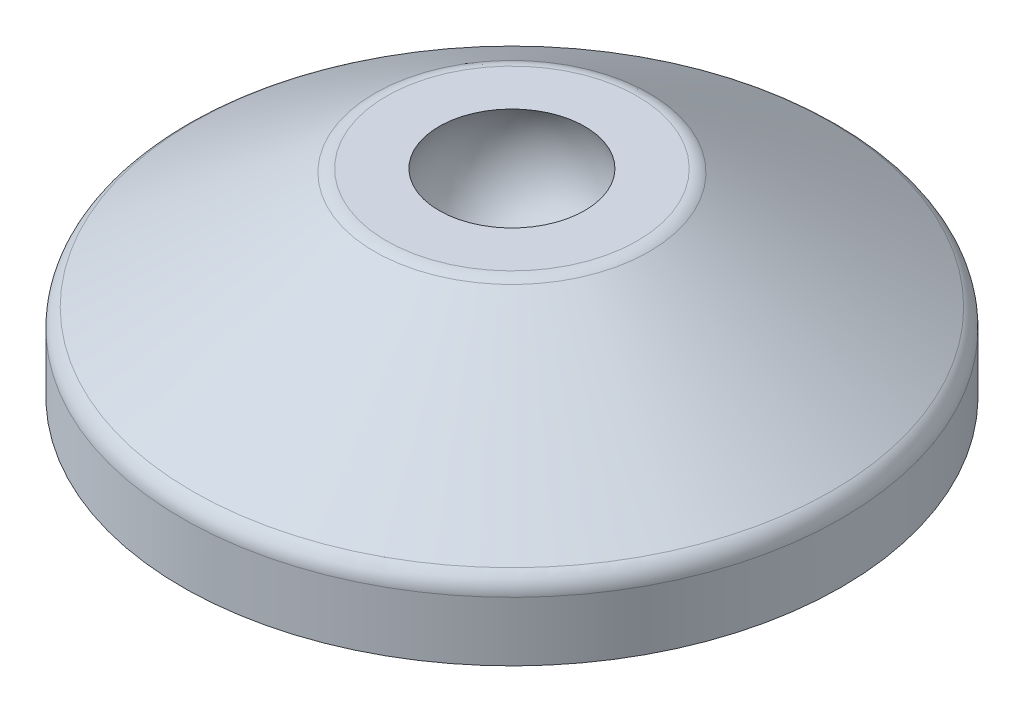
ISO-10303-21;
HEADER;
FILE_DESCRIPTION(('STEP AP214'),'2;1');
FILE_NAME('part.step','',(''),(''),'','','');
FILE_SCHEMA(('AUTOMOTIVE_DESIGN { 1 0 10303 214 1 1 1 1 }'));
ENDSEC;
DATA;
#1=APPLICATION_CONTEXT('core data for automotive mechanical design processes');
#2=APPLICATION_PROTOCOL_DEFINITION('international standard','automotive_design',2000,#1);
#3=PRODUCT_CONTEXT('',#1,'mechanical');
#4=PRODUCT('Part','Part','',(#3));
#5=PRODUCT_RELATED_PRODUCT_CATEGORY('part','',(#4));
#6=PRODUCT_DEFINITION_FORMATION('','',#4);
#7=PRODUCT_DEFINITION_CONTEXT('part definition',#1,'design');
#8=PRODUCT_DEFINITION('design','',#6,#7);
#9=PRODUCT_DEFINITION_SHAPE('','',#8);
#10=(LENGTH_UNIT() NAMED_UNIT(*) SI_UNIT(.MILLI.,.METRE.));
#11=(NAMED_UNIT(*) PLANE_ANGLE_UNIT() SI_UNIT($,.RADIAN.));
#12=(NAMED_UNIT(*) SI_UNIT($,.STERADIAN.) SOLID_ANGLE_UNIT());
#13=UNCERTAINTY_MEASURE_WITH_UNIT(LENGTH_MEASURE(1.E-05),#10,'distance_accuracy_value','');
#14=(GEOMETRIC_REPRESENTATION_CONTEXT(3) GLOBAL_UNCERTAINTY_ASSIGNED_CONTEXT((#13)) GLOBAL_UNIT_ASSIGNED_CONTEXT((#10,
#11,#12)) REPRESENTATION_CONTEXT('',''));
#15=CARTESIAN_POINT('',(0.,0.,0.));
#16=DIRECTION('',(0.,0.,1.));
#17=DIRECTION('',(1.,0.,0.));
#18=AXIS2_PLACEMENT_3D('',#15,#16,#17);
#19=CARTESIAN_POINT('',(0.,0.999999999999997,0.));
#20=DIRECTION('',(0.,1.,0.));
#21=DIRECTION('',(0.,0.,1.));
#22=AXIS2_PLACEMENT_3D('',#19,#20,#21);
#23=PLANE('',#22);
#24=CARTESIAN_POINT('',(0.,0.999999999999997,0.));
#25=DIRECTION('',(0.,1.,0.));
#26=DIRECTION('',(-1.,0.,0.));
#27=AXIS2_PLACEMENT_3D('',#24,#25,#26);
#28=CIRCLE('',#27,7.5);
#29=CARTESIAN_POINT('',(-7.5,0.999999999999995,0.));
#30=VERTEX_POINT('',#29);
#31=EDGE_CURVE('E18',#30,#30,#28,.T.);
#32=ORIENTED_EDGE('',*,*,#31,.F.);
#33=EDGE_LOOP('',(#32));
#34=FACE_BOUND('',#33,.T.);
#35=ADVANCED_FACE('F14',(#34),#23,.F.);
#36=CARTESIAN_POINT('',(0.,0.,0.));
#37=DIRECTION('',(0.,1.,0.));
#38=DIRECTION('',(-1.,0.,0.));
#39=AXIS2_PLACEMENT_3D('',#36,#37,#38);
#40=CYLINDRICAL_SURFACE('',#39,7.5);
#41=CARTESIAN_POINT('',(0.,5.,0.));
#42=DIRECTION('',(0.,1.,0.));
#43=DIRECTION('',(-1.,0.,0.));
#44=AXIS2_PLACEMENT_3D('',#41,#42,#43);
#45=CIRCLE('',#44,7.5);
#46=CARTESIAN_POINT('',(-7.5,4.99999999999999,0.));
#47=VERTEX_POINT('',#46);
#48=EDGE_CURVE('E72',#47,#47,#45,.F.);
#49=ORIENTED_EDGE('',*,*,#48,.T.);
#50=EDGE_LOOP('',(#49));
#51=FACE_BOUND('',#50,.T.);
#52=ORIENTED_EDGE('',*,*,#31,.T.);
#53=EDGE_LOOP('',(#52));
#54=FACE_BOUND('',#53,.T.);
#55=ADVANCED_FACE('F79',(#51,#54),#40,.T.);
#56=CARTESIAN_POINT('',(0.,5.,0.));
#57=DIRECTION('',(0.,1.,0.));
#58=DIRECTION('',(0.,0.,1.));
#59=AXIS2_PLACEMENT_3D('',#56,#57,#58);
#60=PLANE('',#59);
#61=ORIENTED_EDGE('',*,*,#48,.F.);
#62=EDGE_LOOP('',(#61));
#63=FACE_BOUND('',#62,.T.);
#64=CARTESIAN_POINT('',(0.,5.,0.));
#65=DIRECTION('',(0.,1.,0.));
#66=DIRECTION('',(0.,0.,1.));
#67=AXIS2_PLACEMENT_3D('',#64,#65,#66);
#68=CIRCLE('',#67,26.);
#69=CARTESIAN_POINT('',(0.,5.,26.));
#70=VERTEX_POINT('',#69);
#71=EDGE_CURVE('E70',#70,#70,#68,.F.);
#72=ORIENTED_EDGE('',*,*,#71,.T.);
#73=EDGE_LOOP('',(#72));
#74=FACE_BOUND('',#73,.T.);
#75=ADVANCED_FACE('F86',(#63,#74),#60,.F.);
#76=CARTESIAN_POINT('',(0.,0.,0.));
#77=DIRECTION('',(0.,1.,0.));
#78=DIRECTION('',(0.,0.,1.));
#79=AXIS2_PLACEMENT_3D('',#76,#77,#78);
#80=CYLINDRICAL_SURFACE('',#79,26.);
#81=CARTESIAN_POINT('',(0.,0.,0.));
#82=DIRECTION('',(0.,1.,0.));
#83=DIRECTION('',(0.,0.,1.));
#84=AXIS2_PLACEMENT_3D('',#81,#82,#83);
#85=CIRCLE('',#84,26.);
#86=CARTESIAN_POINT('',(0.,0.,26.));
#87=VERTEX_POINT('',#86);
#88=EDGE_CURVE('E67',#87,#87,#85,.T.);
#89=ORIENTED_EDGE('',*,*,#88,.F.);
#90=EDGE_LOOP('',(#89));
#91=FACE_BOUND('',#90,.T.);
#92=ORIENTED_EDGE('',*,*,#71,.F.);
#93=EDGE_LOOP('',(#92));
#94=FACE_BOUND('',#93,.T.);
#95=ADVANCED_FACE('F122',(#91,#94),#80,.F.);
#96=CARTESIAN_POINT('',(15.,0.,0.));
#97=DIRECTION('',(0.,-1.,0.));
#98=DIRECTION('',(0.,0.,-1.));
#99=AXIS2_PLACEMENT_3D('',#96,#97,#98);
#100=PLANE('',#99);
#101=ORIENTED_EDGE('',*,*,#88,.T.);
#102=EDGE_LOOP('',(#101));
#103=FACE_BOUND('',#102,.T.);
#104=CARTESIAN_POINT('',(0.,0.,0.));
#105=DIRECTION('',(0.,-1.,0.));
#106=DIRECTION('',(1.,0.,0.));
#107=AXIS2_PLACEMENT_3D('',#104,#105,#106);
#108=CIRCLE('',#107,30.);
#109=CARTESIAN_POINT('',(30.,0.,0.));
#110=VERTEX_POINT('',#109);
#111=EDGE_CURVE('E64',#110,#110,#108,.F.);
#112=ORIENTED_EDGE('',*,*,#111,.F.);
#113=EDGE_LOOP('',(#112));
#114=FACE_BOUND('',#113,.T.);
#115=ADVANCED_FACE('F119',(#103,#114),#100,.T.);
#116=CARTESIAN_POINT('',(0.,14.5,0.));
#117=DIRECTION('',(0.,0.,1.));
#118=DIRECTION('',(1.,0.,0.));
#119=AXIS2_PLACEMENT_3D('',#116,#117,#118);
#120=SPHERICAL_SURFACE('',#119,7.5);
#121=CARTESIAN_POINT('',(0.,14.5,0.));
#122=DIRECTION('',(0.,1.,0.));
#123=DIRECTION('',(0.,0.,1.));
#124=AXIS2_PLACEMENT_3D('',#121,#122,#123);
#125=SPHERICAL_SURFACE('',#124,7.5);
#126=CARTESIAN_POINT('',(0.,18.,0.));
#127=DIRECTION('',(0.,1.,0.));
#128=DIRECTION('',(0.,0.,1.));
#129=AXIS2_PLACEMENT_3D('',#126,#127,#128);
#130=CIRCLE('',#129,6.6332495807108);
#131=CARTESIAN_POINT('',(0.,18.,6.6332495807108));
#132=VERTEX_POINT('',#131);
#133=EDGE_CURVE('E55',#132,#132,#130,.F.);
#134=ORIENTED_EDGE('',*,*,#133,.F.);
#135=EDGE_LOOP('',(#134));
#136=FACE_BOUND('',#135,.T.);
#137=ADVANCED_FACE('F16',(#136),#125,.F.);
#138=CARTESIAN_POINT('',(0.,2.70222170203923,0.));
#139=DIRECTION('',(0.,-1.,0.));
#140=DIRECTION('',(1.,0.,0.));
#141=AXIS2_PLACEMENT_3D('',#138,#139,#140);
#142=CYLINDRICAL_SURFACE('',#141,30.);
#143=CARTESIAN_POINT('',(0.,5.40444340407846,0.));
#144=DIRECTION('',(0.,-1.,0.));
#145=DIRECTION('',(0.,0.,-1.));
#146=AXIS2_PLACEMENT_3D('',#143,#144,#145);
#147=CIRCLE('',#146,30.);
#148=CARTESIAN_POINT('',(0.,5.40444340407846,-30.));
#149=VERTEX_POINT('',#148);
#150=EDGE_CURVE('E63',#149,#149,#147,.F.);
#151=ORIENTED_EDGE('',*,*,#150,.F.);
#152=EDGE_LOOP('',(#151));
#153=FACE_BOUND('',#152,.T.);
#154=ORIENTED_EDGE('',*,*,#111,.T.);
#155=EDGE_LOOP('',(#154));
#156=FACE_BOUND('',#155,.T.);
#157=ADVANCED_FACE('F115',(#153,#156),#142,.T.);
#158=CARTESIAN_POINT('',(9.02445006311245,18.,0.));
#159=DIRECTION('',(0.,1.,0.));
#160=DIRECTION('',(0.,0.,1.));
#161=AXIS2_PLACEMENT_3D('',#158,#159,#160);
#162=PLANE('',#161);
#163=ORIENTED_EDGE('',*,*,#133,.T.);
#164=EDGE_LOOP('',(#163));
#165=FACE_BOUND('',#164,.T.);
#166=CARTESIAN_POINT('',(0.,18.,0.));
#167=DIRECTION('',(0.,-1.,0.));
#168=DIRECTION('',(1.,0.,0.));
#169=AXIS2_PLACEMENT_3D('',#166,#167,#168);
#170=CIRCLE('',#169,11.4156505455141);
#171=CARTESIAN_POINT('',(11.4156505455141,18.,0.));
#172=VERTEX_POINT('',#171);
#173=EDGE_CURVE('E27',#172,#172,#170,.T.);
#174=ORIENTED_EDGE('',*,*,#173,.F.);
#175=EDGE_LOOP('',(#174));
#176=FACE_BOUND('',#175,.T.);
#177=ADVANCED_FACE('F96',(#165,#176),#162,.T.);
#178=CARTESIAN_POINT('',(0.,5.40444340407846,0.));
#179=DIRECTION('',(0.,-1.,0.));
#180=DIRECTION('',(0.,0.,-1.));
#181=AXIS2_PLACEMENT_3D('',#178,#179,#180);
#182=TOROIDAL_SURFACE('',#181,28.,2.);
#183=CARTESIAN_POINT('',(0.,7.08983591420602,0.));
#184=DIRECTION('',(0.,-1.,0.));
#185=DIRECTION('',(1.,0.,0.));
#186=AXIS2_PLACEMENT_3D('',#183,#184,#185);
#187=CIRCLE('',#186,29.076778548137);
#188=CARTESIAN_POINT('',(29.076778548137,7.08983591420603,0.));
#189=VERTEX_POINT('',#188);
#190=EDGE_CURVE('E22',#189,#189,#187,.F.);
#191=ORIENTED_EDGE('',*,*,#190,.F.);
#192=EDGE_LOOP('',(#191));
#193=FACE_BOUND('',#192,.T.);
#194=ORIENTED_EDGE('',*,*,#150,.T.);
#195=EDGE_LOOP('',(#194));
#196=FACE_BOUND('',#195,.T.);
#197=ADVANCED_FACE('F45',(#193,#196),#182,.T.);
#198=CARTESIAN_POINT('',(0.,16.,0.));
#199=DIRECTION('',(0.,-1.,0.));
#200=DIRECTION('',(0.,0.,-1.));
#201=AXIS2_PLACEMENT_3D('',#198,#199,#200);
#202=TOROIDAL_SURFACE('',#201,11.4156505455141,2.);
#203=ORIENTED_EDGE('',*,*,#173,.T.);
#204=EDGE_LOOP('',(#203));
#205=FACE_BOUND('',#204,.T.);
#206=CARTESIAN_POINT('',(0.,17.685392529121,0.));
#207=DIRECTION('',(0.,-1.,0.));
#208=DIRECTION('',(1.,0.,0.));
#209=AXIS2_PLACEMENT_3D('',#206,#207,#208);
#210=CIRCLE('',#209,12.4924291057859);
#211=CARTESIAN_POINT('',(12.4924291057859,17.685392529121,0.));
#212=VERTEX_POINT('',#211);
#213=EDGE_CURVE('E10',#212,#212,#210,.T.);
#214=ORIENTED_EDGE('',*,*,#213,.F.);
#215=EDGE_LOOP('',(#214));
#216=FACE_BOUND('',#215,.T.);
#217=ADVANCED_FACE('F39',(#205,#216),#202,.T.);
#218=CARTESIAN_POINT('',(0.,7.08983591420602,0.));
#219=DIRECTION('',(0.,-1.,0.));
#220=DIRECTION('',(1.,0.,0.));
#221=AXIS2_PLACEMENT_3D('',#218,#219,#220);
#222=CONICAL_SURFACE('',#221,29.0767785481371,1.00227177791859);
#223=ORIENTED_EDGE('',*,*,#213,.T.);
#224=EDGE_LOOP('',(#223));
#225=FACE_BOUND('',#224,.T.);
#226=ORIENTED_EDGE('',*,*,#190,.T.);
#227=EDGE_LOOP('',(#226));
#228=FACE_BOUND('',#227,.T.);
#229=ADVANCED_FACE('F44',(#225,#228),#222,.T.);
#230=CLOSED_SHELL('',(#35,#55,#75,#95,#115,#137,#157,#177,#197,#217,#229));
#231=MANIFOLD_SOLID_BREP('B1',#230);
#232=ADVANCED_BREP_SHAPE_REPRESENTATION('',(#18,#231),#14);
#233=SHAPE_DEFINITION_REPRESENTATION(#9,#232);
ENDSEC;
END-ISO-10303-21;
